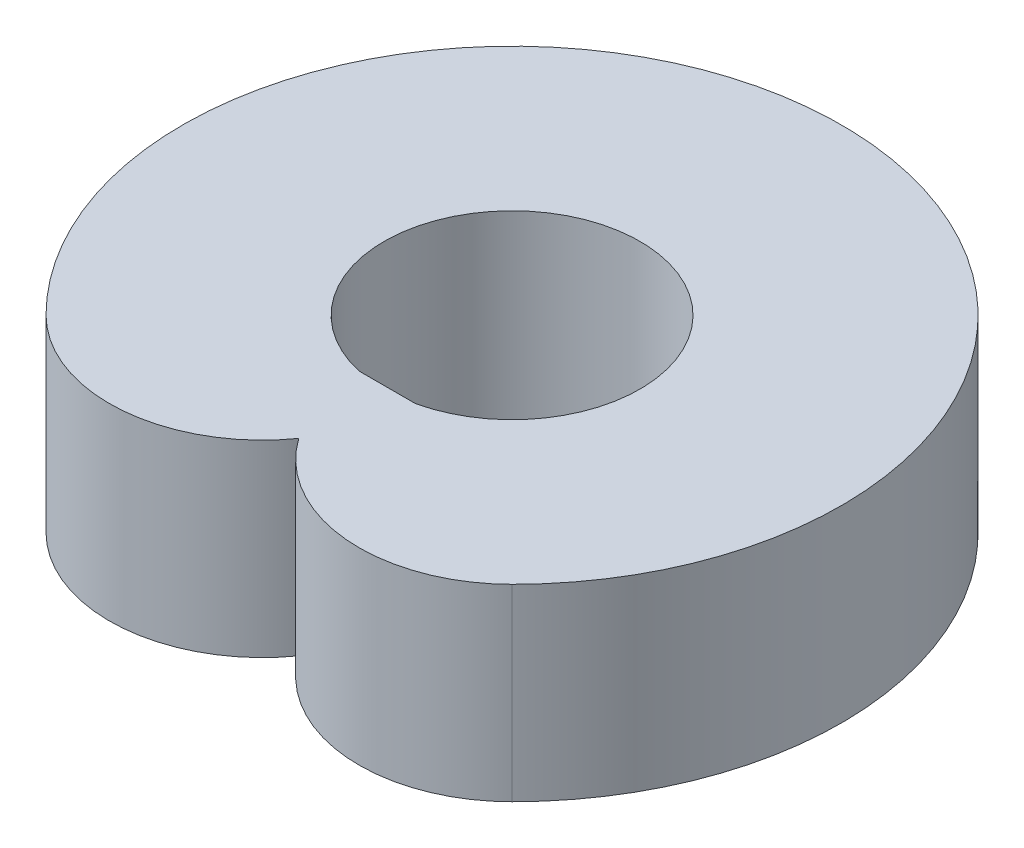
from build123d import *

# Parameters (mm, degrees)
EXTRUDE_1_DEPTH = 400


with BuildPart() as part:
    # Sketch 1 → Extrude 1 (new body)
    with BuildSketch(Plane(origin=(0, 0, 0), x_dir=(1, 0, 0), z_dir=(0, 1, 0))):
        with BuildLine():
            ThreePointArc((494.974746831, -494.974746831), (0, 700), (-494.974746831, -494.974746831))
            ThreePointArc((-494.974746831, -494.974746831), (-237.755805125, -589.007186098), (0, -453.081247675))
            ThreePointArc((0, -453.081247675), (237.755805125, -589.007186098), (494.974746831, -494.974746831))
        make_face()
        with BuildLine():
            Line((59.834957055, -265.165042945), (-59.834957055, -265.165042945))
            ThreePointArc((-59.834957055, -265.165042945), (0, 271.832157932), (59.834957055, -265.165042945))
        make_face(mode=Mode.SUBTRACT)
    extrude(amount=EXTRUDE_1_DEPTH)


solid = part.part
